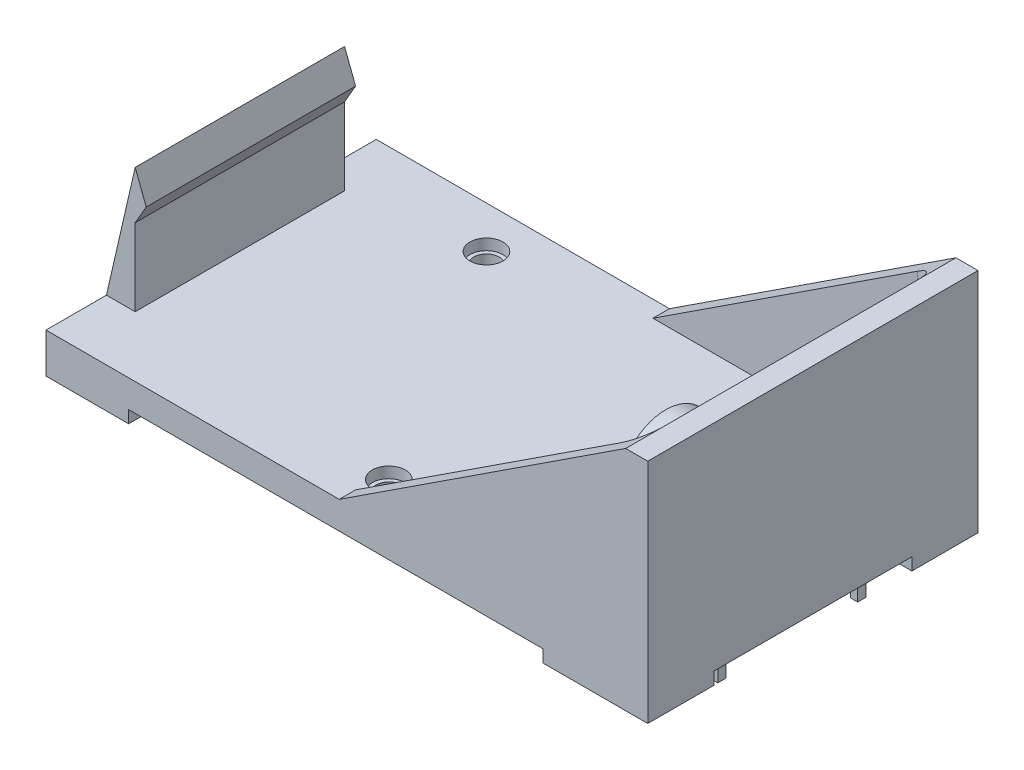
from build123d import *

# Parameters (mm, degrees)
SKETCH_1_W           = 54.61
SKETCH_1_H           = 29.97
EXTRUDE_1_DEPTH      = 2.5
EXTRUDE_2_DEPTH      = 17
CUT_EXTRUDE_1_DEPTH  = 45.989042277
SKETCH_4_R           = 1.145
CUT_EXTRUDE_2_DEPTH  = 36.483985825
SKETCH_5_R           = 2.25
SKETCH_5_W           = 7.5
SKETCH_5_H           = 6
SKETCH_5_W_2         = 9.5
EXTRUDE_3_DEPTH      = 1.12
SKETCH_6_R           = 1.145
CUT_EXTRUDE_3_DEPTH  = 36.483985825
SKETCH_7_R           = 1.5
CUT_EXTRUDE_4_DEPTH  = 1
EXTRUDE_4_DEPTH      = 9.5
EXTRUDE_4_DEPTH_BACK = 9.5
SKETCH_9_W           = 0.66
SKETCH_9_H           = 0.76
EXTRUDE_5_DEPTH      = 3
SKETCH_10_R          = 3.75
EXTRUDE_6_DEPTH      = 1
SKETCH_11_R          = 3
SKETCH_11_R_2        = 2
EXTRUDE_7_DEPTH      = 4
SKETCH_12_R          = 4.25
SKETCH_12_R_2        = 3.25
EXTRUDE_8_DEPTH      = 4


with BuildPart() as part:
    # Sketch 1 → Extrude 1 (new body)
    with BuildSketch(Plane(origin=(0, 0, 0), x_dir=(1, 0, 0), z_dir=(0, 1, 0))):
        Rectangle(SKETCH_1_W, SKETCH_1_H)
    extrude(amount=EXTRUDE_1_DEPTH)

    # Sketch 2 → Extrude 2 (add)
    with BuildSketch(Plane(origin=(0, 2.5, 0), x_dir=(1, 0, 0), z_dir=(0, 1, 0))):
        with BuildLine():
            Line((27.305, -14.985), (-0.695, -14.985))
            Line((-0.695, -14.985), (-0.695, -13.485))
            Line((-0.695, -13.485), (23.305, -13.485))
            ThreePointArc((23.305, -13.485), (24.719213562, -12.899213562), (25.305, -11.485))
            Line((25.305, -11.485), (25.305, 11.485))
            ThreePointArc((25.305, 11.485), (24.719213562, 12.899213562), (23.305, 13.485))
            Line((23.305, 13.485), (-0.695, 13.485))
            Line((-0.695, 13.485), (-0.695, 14.985))
            Line((-0.695, 14.985), (27.305, 14.985))
            Line((27.305, 14.985), (27.305, -14.985))
        make_face()
    extrude(amount=EXTRUDE_2_DEPTH)

    # Sketch 3 → Cut-Extrude 1 (cut, through all)
    with BuildSketch(Plane.XY.offset(14.985)):
        Polygon((-0.695, 2.5), (25.305, 19.5), (-0.695, 19.5), align=None)
    extrude(amount=-CUT_EXTRUDE_1_DEPTH, mode=Mode.SUBTRACT)

    # Sketch 4 → Cut-Extrude 2 (cut, through all)
    with BuildSketch(Plane(origin=(0, 2.5, 0), x_dir=(1, 0, 0), z_dir=(0, 1, 0))):
        with Locations(Location((-13.495, 11.175, 0), (0, 0, 270))):
            Circle(SKETCH_4_R)
        with Locations(Location((-0.005, -11.175, 0), (0, 0, 270))):
            Circle(SKETCH_4_R)
        with Locations(Location((13.475, 11.175, 0), (0, 0, 270))):
            Circle(SKETCH_4_R)
    extrude(amount=-CUT_EXTRUDE_2_DEPTH, mode=Mode.SUBTRACT)

    # Sketch 5 → Extrude 3 (add)
    with BuildSketch(Plane.XZ):
        with Locations(Location((-0.005, 11.175, 0), (0, 0, 90))):
            Circle(SKETCH_5_R)
        with Locations(Location((13.475, -11.175, 0), (0, 0, 90))):
            Circle(SKETCH_5_R)
        with Locations(Location((-13.495, -11.175, 0), (0, 0, 90))):
            Circle(SKETCH_5_R)
        with Locations((-23.555, 11.985)):
            Rectangle(SKETCH_5_W, SKETCH_5_H)
        with Locations((22.555, 11.985)):
            Rectangle(SKETCH_5_W_2, SKETCH_5_H)
        with Locations((22.555, -11.985)):
            Rectangle(SKETCH_5_W_2, SKETCH_5_H)
        with Locations((-23.555, -11.985)):
            Rectangle(SKETCH_5_W, SKETCH_5_H)
    extrude(amount=EXTRUDE_3_DEPTH)

    # Sketch 6 → Cut-Extrude 3 (cut, through all)
    with BuildSketch(Plane(origin=(0, 2.5, 0), x_dir=(1, 0, 0), z_dir=(0, 1, 0))):
        with Locations(Location((-13.495, 11.175, 0), (0, 0, 270))):
            Circle(SKETCH_6_R)
        with Locations(Location((13.475, 11.175, 0), (0, 0, 270))):
            Circle(SKETCH_6_R)
        with Locations(Location((-0.005, -11.175, 0), (0, 0, 270))):
            Circle(SKETCH_6_R)
    extrude(amount=-CUT_EXTRUDE_3_DEPTH, mode=Mode.SUBTRACT)

    # Sketch 7 → Cut-Extrude 4 (cut)
    with BuildSketch(Plane(origin=(0, 2.5, 0), x_dir=(1, 0, 0), z_dir=(0, 1, 0))):
        with Locations(Location((-13.495, 11.175, 0), (0, 0, 270))):
            Circle(SKETCH_7_R)
        with Locations(Location((13.475, 11.175, 0), (0, 0, 270))):
            Circle(SKETCH_7_R)
        with Locations(Location((-0.005, -11.175, 0), (0, 0, 270))):
            Circle(SKETCH_7_R)
    extrude(amount=-CUT_EXTRUDE_4_DEPTH, mode=Mode.SUBTRACT)

    # Sketch 8 → Extrude 4 (add, two sides: drawn at the far end of the back side and taken through both)
    with BuildSketch(Plane.XY.offset(-EXTRUDE_4_DEPTH_BACK)):
        Polygon((-27.305, 2.5), (-24.695, 13.85), (-23.695, 11.232050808), (-24.695, 9.5), (-24.695, 2.5), align=None)
    extrude(amount=EXTRUDE_4_DEPTH + EXTRUDE_4_DEPTH_BACK)

    # Sketch 9 → Extrude 5 (add)
    with BuildSketch(Plane.XZ):
        with Locations((25.075, 6.35)):
            Rectangle(SKETCH_9_W, SKETCH_9_H)
        with Locations((25.075, -6.35)):
            Rectangle(SKETCH_9_W, SKETCH_9_H)
    extrude(amount=EXTRUDE_5_DEPTH)

    # Sketch 10 → Extrude 6 (add)
    with BuildSketch(Plane.ZY.offset(-25.305)):
        with Locations(Location((-6.35, 11.48, 0), (0, 0, 180))):
            Circle(SKETCH_10_R)
        with Locations(Location((6.35, 11.48, 0), (0, 0, 180))):
            Circle(SKETCH_10_R)
    extrude(amount=EXTRUDE_6_DEPTH)

    # Sketch 11 → Extrude 7 (add)
    with BuildSketch(Plane.ZY.offset(-24.305)):
        with Locations((-6.35, 11.48)):
            Circle(SKETCH_11_R)
        with Locations((-6.35, 11.48)):
            Circle(SKETCH_11_R_2, mode=Mode.SUBTRACT)
    extrude(amount=EXTRUDE_7_DEPTH)

    # Sketch 12 → Extrude 8 (add)
    with BuildSketch(Plane.ZY.offset(-24.305)):
        with Locations((6.35, 11.48)):
            Circle(SKETCH_12_R)
        with Locations((6.35, 11.48)):
            Circle(SKETCH_12_R_2, mode=Mode.SUBTRACT)
    extrude(amount=EXTRUDE_8_DEPTH)


solid = part.part
